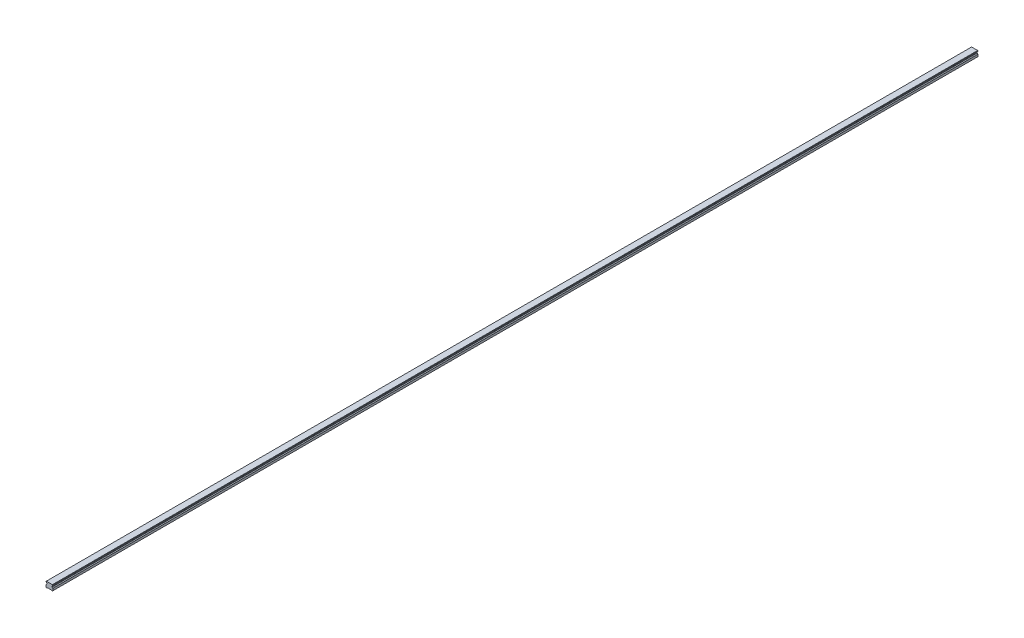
from build123d import *

# Parameters (mm, degrees)
SKETCH1_W           = 20
SKETCH1_H           = 16.3
BOSS_EXTRUDE1_DEPTH = 1370
CUT_EXTRUDE1_DEPTH  = 2741.066730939
CHAMFER1_SIZE       = 1
FILLET1_R           = 1
CUT_EXTRUDE2_DEPTH  = 2741.066730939
SKETCH5_R           = 3
SKETCH5_R_2         = 2.5
CUT_EXTRUDE5_DEPTH  = 10
SKETCH5_2_R         = 2.5
CUT_EXTRUDE6_DEPTH  = 13
LPATTERN2_COUNT     = 46
LPATTERN2_PITCH     = 60


with BuildPart() as part:
    # Sketch1 → Boss-Extrude1 (new, symmetric)
    with BuildSketch(Plane.XY):
        with Locations((0, 8.15)):
            Rectangle(SKETCH1_W, SKETCH1_H)
    extrude(amount=BOSS_EXTRUDE1_DEPTH, both=True)

    # Sketch2 → Cut-Extrude1 (cut, through all)
    with BuildSketch(Plane.XY.offset(1370)):
        Polygon((-10, 14.3), (-10, 7.3), (-7.666666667, 9.633333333), (-7.666666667, 11.966666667), align=None)
        Polygon((7.666666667, 11.966666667), (10, 14.3), (10, 7.3), (7.666666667, 9.633333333), align=None)
    extrude(amount=-CUT_EXTRUDE1_DEPTH, mode=Mode.SUBTRACT)

    # Chamfer1
    chamfer1_edges = [part.edges().sort_by_distance(p)[0] for p in [
        (-10, 16.3, 0),
        (10, 16.3, 0),
        (10, 0, 0),
        (-10, 0, 0),
    ]]
    chamfer(chamfer1_edges, length=CHAMFER1_SIZE)

    # Fillet1
    fillet1_edges = [part.edges().sort_by_distance(p)[0] for p in [
        (-7.666666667, 11.966666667, 0),
        (-7.666666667, 9.633333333, 0),
        (7.666666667, 9.633333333, 0),
        (7.666666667, 11.966666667, 0),
    ]]
    fillet(fillet1_edges, radius=FILLET1_R)

    # Sketch3 → Cut-Extrude2 (cut, through all)
    with BuildSketch(Plane.XY.offset(1370)):
        Polygon((-6, 0), (-5, 1), (5, 1), (6, 0), align=None)
    extrude(amount=-CUT_EXTRUDE2_DEPTH, mode=Mode.SUBTRACT)

    # Sketch5 → Cut-Extrude5 (cut)
    with BuildSketch(Plane.XZ.offset(-1)):
        with Locations(Location((0, 1350, 0), (0, 0, 270))):
            Circle(SKETCH5_R)
        with Locations(Location((0, 1350, 0), (0, 0, 270))):
            Circle(SKETCH5_R_2, mode=Mode.SUBTRACT)
    cut_extrude5 = extrude(amount=-CUT_EXTRUDE5_DEPTH, mode=Mode.SUBTRACT)

    # Sketch5_2 → Cut-Extrude6 (cut)
    with BuildSketch(Plane.XZ.offset(-1)):
        with Locations(Location((0, 1350, 0), (0, 0, 270))):
            Circle(SKETCH5_2_R)
    cut_extrude6 = extrude(amount=-CUT_EXTRUDE6_DEPTH, mode=Mode.SUBTRACT)

    # Cut-Extrude7 cone 1 section (on through the dimple's axis) → Cut-Extrude7 (revolve, cut)
    with BuildSketch(Plane(origin=(0, 14, 1350), x_dir=(0, 0, -1), z_dir=(1, 0, 0))):
        Polygon((0, 0), (2.5, 0), (0, 1.443375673), align=None)
    cut_extrude7 = revolve(axis=Axis((0, 14, 1350), (0, 1, 0)), mode=Mode.SUBTRACT)

    # LPattern2: Cut-Extrude5, Cut-Extrude6, Cut-Extrude7 ×46
    with Locations(*[(0, 0, -i * LPATTERN2_PITCH) for i in range(1, LPATTERN2_COUNT)]):
        add(cut_extrude5, mode=Mode.SUBTRACT)
        add(cut_extrude6, mode=Mode.SUBTRACT)
        add(cut_extrude7, mode=Mode.SUBTRACT)


solid = part.part
